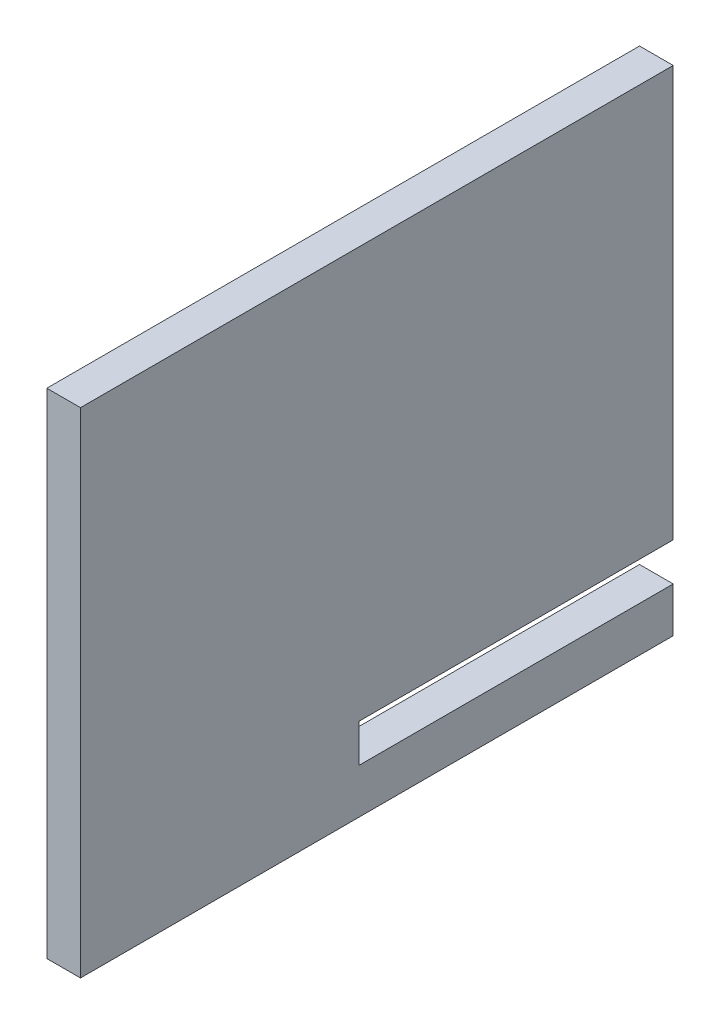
ISO-10303-21;
HEADER;
FILE_DESCRIPTION(('STEP AP214'),'2;1');
FILE_NAME('part.step','',(''),(''),'','','');
FILE_SCHEMA(('AUTOMOTIVE_DESIGN { 1 0 10303 214 1 1 1 1 }'));
ENDSEC;
DATA;
#1=APPLICATION_CONTEXT('core data for automotive mechanical design processes');
#2=APPLICATION_PROTOCOL_DEFINITION('international standard','automotive_design',2000,#1);
#3=PRODUCT_CONTEXT('',#1,'mechanical');
#4=PRODUCT('Part','Part','',(#3));
#5=PRODUCT_RELATED_PRODUCT_CATEGORY('part','',(#4));
#6=PRODUCT_DEFINITION_FORMATION('','',#4);
#7=PRODUCT_DEFINITION_CONTEXT('part definition',#1,'design');
#8=PRODUCT_DEFINITION('design','',#6,#7);
#9=PRODUCT_DEFINITION_SHAPE('','',#8);
#10=(LENGTH_UNIT() NAMED_UNIT(*) SI_UNIT(.MILLI.,.METRE.));
#11=(NAMED_UNIT(*) PLANE_ANGLE_UNIT() SI_UNIT($,.RADIAN.));
#12=(NAMED_UNIT(*) SI_UNIT($,.STERADIAN.) SOLID_ANGLE_UNIT());
#13=UNCERTAINTY_MEASURE_WITH_UNIT(LENGTH_MEASURE(1.E-05),#10,'distance_accuracy_value','');
#14=(GEOMETRIC_REPRESENTATION_CONTEXT(3) GLOBAL_UNCERTAINTY_ASSIGNED_CONTEXT((#13)) GLOBAL_UNIT_ASSIGNED_CONTEXT((#10,
#11,#12)) REPRESENTATION_CONTEXT('',''));
#15=CARTESIAN_POINT('',(0.,0.,0.));
#16=DIRECTION('',(0.,0.,1.));
#17=DIRECTION('',(1.,0.,0.));
#18=AXIS2_PLACEMENT_3D('',#15,#16,#17);
#19=CARTESIAN_POINT('',(0.,0.,0.));
#20=DIRECTION('',(0.,0.,-1.));
#21=DIRECTION('',(-1.,0.,0.));
#22=AXIS2_PLACEMENT_3D('',#19,#20,#21);
#23=PLANE('',#22);
#24=DIRECTION('',(1.,0.,0.));
#25=VECTOR('',#24,1.);
#26=CARTESIAN_POINT('',(-32.352836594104,-0.850000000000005,0.));
#27=LINE('',#26,#25);
#28=CARTESIAN_POINT('',(-18.25,-0.850000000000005,0.));
#29=VERTEX_POINT('',#28);
#30=CARTESIAN_POINT('',(-16.75,-0.850000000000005,0.));
#31=VERTEX_POINT('',#30);
#32=EDGE_CURVE('E111',#29,#31,#27,.T.);
#33=ORIENTED_EDGE('',*,*,#32,.T.);
#34=DIRECTION('',(0.,1.,0.));
#35=VECTOR('',#34,1.);
#36=CARTESIAN_POINT('',(-16.75,-39.75,0.));
#37=LINE('',#36,#35);
#38=CARTESIAN_POINT('',(-16.75,-19.15,0.));
#39=VERTEX_POINT('',#38);
#40=EDGE_CURVE('E108',#39,#31,#37,.T.);
#41=ORIENTED_EDGE('',*,*,#40,.F.);
#42=DIRECTION('',(1.,0.,0.));
#43=VECTOR('',#42,1.);
#44=CARTESIAN_POINT('',(-32.352836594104,-19.15,0.));
#45=LINE('',#44,#43);
#46=CARTESIAN_POINT('',(-18.25,-19.15,0.));
#47=VERTEX_POINT('',#46);
#48=EDGE_CURVE('E147',#47,#39,#45,.T.);
#49=ORIENTED_EDGE('',*,*,#48,.F.);
#50=DIRECTION('',(0.,-1.,0.));
#51=VECTOR('',#50,1.);
#52=CARTESIAN_POINT('',(-18.25,-39.75,0.));
#53=LINE('',#52,#51);
#54=EDGE_CURVE('E58',#29,#47,#53,.T.);
#55=ORIENTED_EDGE('',*,*,#54,.F.);
#56=EDGE_LOOP('',(#33,#41,#49,#55));
#57=FACE_BOUND('',#56,.T.);
#58=ADVANCED_FACE('F33',(#57),#23,.T.);
#59=DIRECTION('',(1.,0.,0.));
#60=VECTOR('',#59,1.);
#61=CARTESIAN_POINT('',(-66.6785040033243,-22.85,0.));
#62=LINE('',#61,#60);
#63=CARTESIAN_POINT('',(-18.25,-22.85,0.));
#64=VERTEX_POINT('',#63);
#65=CARTESIAN_POINT('',(-16.75,-22.85,0.));
#66=VERTEX_POINT('',#65);
#67=EDGE_CURVE('E124',#64,#66,#62,.T.);
#68=ORIENTED_EDGE('',*,*,#67,.F.);
#69=CARTESIAN_POINT('',(-18.25,-20.85,0.));
#70=VERTEX_POINT('',#69);
#71=EDGE_CURVE('E156',#70,#64,#53,.T.);
#72=ORIENTED_EDGE('',*,*,#71,.F.);
#73=DIRECTION('',(1.,0.,0.));
#74=VECTOR('',#73,1.);
#75=CARTESIAN_POINT('',(-32.352836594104,-20.85,0.));
#76=LINE('',#75,#74);
#77=CARTESIAN_POINT('',(-16.75,-20.85,0.));
#78=VERTEX_POINT('',#77);
#79=EDGE_CURVE('E136',#70,#78,#76,.T.);
#80=ORIENTED_EDGE('',*,*,#79,.T.);
#81=EDGE_CURVE('E37',#66,#78,#37,.T.);
#82=ORIENTED_EDGE('',*,*,#81,.F.);
#83=EDGE_LOOP('',(#68,#72,#80,#82));
#84=FACE_BOUND('',#83,.T.);
#85=ADVANCED_FACE('F163',(#84),#23,.T.);
#86=CARTESIAN_POINT('',(-18.25,-39.75,26.4));
#87=DIRECTION('',(1.,0.,0.));
#88=DIRECTION('',(0.,0.,-1.));
#89=AXIS2_PLACEMENT_3D('',#86,#87,#88);
#90=PLANE('',#89);
#91=DIRECTION('',(0.,-1.,0.));
#92=VECTOR('',#91,1.);
#93=CARTESIAN_POINT('',(-18.25,-39.75,26.4));
#94=LINE('',#93,#92);
#95=CARTESIAN_POINT('',(-18.25,-0.850000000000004,26.4));
#96=VERTEX_POINT('',#95);
#97=CARTESIAN_POINT('',(-18.25,-22.85,26.4));
#98=VERTEX_POINT('',#97);
#99=EDGE_CURVE('E42',#96,#98,#94,.T.);
#100=ORIENTED_EDGE('',*,*,#99,.F.);
#101=DIRECTION('',(0.,0.,1.));
#102=VECTOR('',#101,1.);
#103=CARTESIAN_POINT('',(-18.25,-0.850000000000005,0.));
#104=LINE('',#103,#102);
#105=EDGE_CURVE('E117',#29,#96,#104,.T.);
#106=ORIENTED_EDGE('',*,*,#105,.F.);
#107=ORIENTED_EDGE('',*,*,#54,.T.);
#108=DIRECTION('',(0.,0.,-1.));
#109=VECTOR('',#108,1.);
#110=CARTESIAN_POINT('',(-18.25,-19.15,0.));
#111=LINE('',#110,#109);
#112=CARTESIAN_POINT('',(-18.25,-19.15,14.));
#113=VERTEX_POINT('',#112);
#114=EDGE_CURVE('E138',#113,#47,#111,.T.);
#115=ORIENTED_EDGE('',*,*,#114,.F.);
#116=DIRECTION('',(0.,1.,0.));
#117=VECTOR('',#116,1.);
#118=CARTESIAN_POINT('',(-18.25,-20.85,14.));
#119=LINE('',#118,#117);
#120=CARTESIAN_POINT('',(-18.25,-20.85,14.));
#121=VERTEX_POINT('',#120);
#122=EDGE_CURVE('E133',#121,#113,#119,.T.);
#123=ORIENTED_EDGE('',*,*,#122,.F.);
#124=DIRECTION('',(0.,0.,1.));
#125=VECTOR('',#124,1.);
#126=CARTESIAN_POINT('',(-18.25,-20.85,0.));
#127=LINE('',#126,#125);
#128=EDGE_CURVE('E135',#70,#121,#127,.T.);
#129=ORIENTED_EDGE('',*,*,#128,.F.);
#130=ORIENTED_EDGE('',*,*,#71,.T.);
#131=DIRECTION('',(0.,0.,-1.));
#132=VECTOR('',#131,1.);
#133=CARTESIAN_POINT('',(-18.25,-22.85,0.));
#134=LINE('',#133,#132);
#135=EDGE_CURVE('E112',#98,#64,#134,.T.);
#136=ORIENTED_EDGE('',*,*,#135,.F.);
#137=EDGE_LOOP('',(#100,#106,#107,#115,#123,#129,#130,#136));
#138=FACE_BOUND('',#137,.T.);
#139=ADVANCED_FACE('F35',(#138),#90,.F.);
#140=CARTESIAN_POINT('',(-16.75,-39.75,26.4));
#141=DIRECTION('',(-1.,0.,0.));
#142=DIRECTION('',(0.,0.,1.));
#143=AXIS2_PLACEMENT_3D('',#140,#141,#142);
#144=PLANE('',#143);
#145=DIRECTION('',(0.,0.,-1.));
#146=VECTOR('',#145,1.);
#147=CARTESIAN_POINT('',(-16.75,-0.850000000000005,0.));
#148=LINE('',#147,#146);
#149=CARTESIAN_POINT('',(-16.75,-0.850000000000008,26.4));
#150=VERTEX_POINT('',#149);
#151=EDGE_CURVE('E103',#150,#31,#148,.T.);
#152=ORIENTED_EDGE('',*,*,#151,.F.);
#153=DIRECTION('',(0.,1.,0.));
#154=VECTOR('',#153,1.);
#155=CARTESIAN_POINT('',(-16.75,-39.75,26.4));
#156=LINE('',#155,#154);
#157=CARTESIAN_POINT('',(-16.75,-22.85,26.4));
#158=VERTEX_POINT('',#157);
#159=EDGE_CURVE('E11',#158,#150,#156,.T.);
#160=ORIENTED_EDGE('',*,*,#159,.F.);
#161=DIRECTION('',(0.,0.,1.));
#162=VECTOR('',#161,1.);
#163=CARTESIAN_POINT('',(-16.75,-22.85,0.));
#164=LINE('',#163,#162);
#165=EDGE_CURVE('E50',#66,#158,#164,.T.);
#166=ORIENTED_EDGE('',*,*,#165,.F.);
#167=ORIENTED_EDGE('',*,*,#81,.T.);
#168=DIRECTION('',(0.,0.,-1.));
#169=VECTOR('',#168,1.);
#170=CARTESIAN_POINT('',(-16.75,-20.85,0.));
#171=LINE('',#170,#169);
#172=CARTESIAN_POINT('',(-16.75,-20.85,14.));
#173=VERTEX_POINT('',#172);
#174=EDGE_CURVE('E144',#173,#78,#171,.T.);
#175=ORIENTED_EDGE('',*,*,#174,.F.);
#176=DIRECTION('',(0.,-1.,0.));
#177=VECTOR('',#176,1.);
#178=CARTESIAN_POINT('',(-16.75,-20.85,14.));
#179=LINE('',#178,#177);
#180=CARTESIAN_POINT('',(-16.75,-19.15,14.));
#181=VERTEX_POINT('',#180);
#182=EDGE_CURVE('E141',#181,#173,#179,.T.);
#183=ORIENTED_EDGE('',*,*,#182,.F.);
#184=DIRECTION('',(0.,0.,1.));
#185=VECTOR('',#184,1.);
#186=CARTESIAN_POINT('',(-16.75,-19.15,0.));
#187=LINE('',#186,#185);
#188=EDGE_CURVE('E130',#39,#181,#187,.T.);
#189=ORIENTED_EDGE('',*,*,#188,.F.);
#190=ORIENTED_EDGE('',*,*,#40,.T.);
#191=EDGE_LOOP('',(#152,#160,#166,#167,#175,#183,#189,#190));
#192=FACE_BOUND('',#191,.T.);
#193=ADVANCED_FACE('F105',(#192),#144,.F.);
#194=CARTESIAN_POINT('',(0.,0.,26.4));
#195=DIRECTION('',(0.,0.,-1.));
#196=DIRECTION('',(-1.,0.,0.));
#197=AXIS2_PLACEMENT_3D('',#194,#195,#196);
#198=PLANE('',#197);
#199=ORIENTED_EDGE('',*,*,#159,.T.);
#200=DIRECTION('',(1.,0.,0.));
#201=VECTOR('',#200,1.);
#202=CARTESIAN_POINT('',(-66.6785040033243,-0.850000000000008,26.4));
#203=LINE('',#202,#201);
#204=EDGE_CURVE('E115',#96,#150,#203,.T.);
#205=ORIENTED_EDGE('',*,*,#204,.F.);
#206=ORIENTED_EDGE('',*,*,#99,.T.);
#207=DIRECTION('',(1.,0.,0.));
#208=VECTOR('',#207,1.);
#209=CARTESIAN_POINT('',(-66.6785040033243,-22.85,26.4));
#210=LINE('',#209,#208);
#211=EDGE_CURVE('E122',#98,#158,#210,.T.);
#212=ORIENTED_EDGE('',*,*,#211,.T.);
#213=EDGE_LOOP('',(#199,#205,#206,#212));
#214=FACE_BOUND('',#213,.T.);
#215=ADVANCED_FACE('F121',(#214),#198,.F.);
#216=CARTESIAN_POINT('',(-32.352836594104,-20.85,0.));
#217=DIRECTION('',(0.,-1.,0.));
#218=DIRECTION('',(0.,0.,-1.));
#219=AXIS2_PLACEMENT_3D('',#216,#217,#218);
#220=PLANE('',#219);
#221=ORIENTED_EDGE('',*,*,#128,.T.);
#222=DIRECTION('',(1.,0.,0.));
#223=VECTOR('',#222,1.);
#224=CARTESIAN_POINT('',(-32.352836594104,-20.85,14.));
#225=LINE('',#224,#223);
#226=EDGE_CURVE('E150',#121,#173,#225,.T.);
#227=ORIENTED_EDGE('',*,*,#226,.T.);
#228=ORIENTED_EDGE('',*,*,#174,.T.);
#229=ORIENTED_EDGE('',*,*,#79,.F.);
#230=EDGE_LOOP('',(#221,#227,#228,#229));
#231=FACE_BOUND('',#230,.T.);
#232=ADVANCED_FACE('F169',(#231),#220,.F.);
#233=CARTESIAN_POINT('',(-32.352836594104,-20.85,14.));
#234=DIRECTION('',(0.,0.,1.));
#235=DIRECTION('',(1.,0.,0.));
#236=AXIS2_PLACEMENT_3D('',#233,#234,#235);
#237=PLANE('',#236);
#238=ORIENTED_EDGE('',*,*,#122,.T.);
#239=DIRECTION('',(1.,0.,0.));
#240=VECTOR('',#239,1.);
#241=CARTESIAN_POINT('',(-32.352836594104,-19.15,14.));
#242=LINE('',#241,#240);
#243=EDGE_CURVE('E152',#113,#181,#242,.T.);
#244=ORIENTED_EDGE('',*,*,#243,.T.);
#245=ORIENTED_EDGE('',*,*,#182,.T.);
#246=ORIENTED_EDGE('',*,*,#226,.F.);
#247=EDGE_LOOP('',(#238,#244,#245,#246));
#248=FACE_BOUND('',#247,.T.);
#249=ADVANCED_FACE('F172',(#248),#237,.F.);
#250=CARTESIAN_POINT('',(-32.352836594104,-19.15,0.));
#251=DIRECTION('',(0.,1.,0.));
#252=DIRECTION('',(0.,0.,1.));
#253=AXIS2_PLACEMENT_3D('',#250,#251,#252);
#254=PLANE('',#253);
#255=ORIENTED_EDGE('',*,*,#114,.T.);
#256=ORIENTED_EDGE('',*,*,#48,.T.);
#257=ORIENTED_EDGE('',*,*,#188,.T.);
#258=ORIENTED_EDGE('',*,*,#243,.F.);
#259=EDGE_LOOP('',(#255,#256,#257,#258));
#260=FACE_BOUND('',#259,.T.);
#261=ADVANCED_FACE('F177',(#260),#254,.F.);
#262=CARTESIAN_POINT('',(-32.352836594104,-0.850000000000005,0.));
#263=DIRECTION('',(0.,-1.,0.));
#264=DIRECTION('',(0.,0.,-1.));
#265=AXIS2_PLACEMENT_3D('',#262,#263,#264);
#266=PLANE('',#265);
#267=ORIENTED_EDGE('',*,*,#105,.T.);
#268=ORIENTED_EDGE('',*,*,#204,.T.);
#269=ORIENTED_EDGE('',*,*,#151,.T.);
#270=ORIENTED_EDGE('',*,*,#32,.F.);
#271=EDGE_LOOP('',(#267,#268,#269,#270));
#272=FACE_BOUND('',#271,.T.);
#273=ADVANCED_FACE('F116',(#272),#266,.F.);
#274=CARTESIAN_POINT('',(-66.6785040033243,-22.85,0.));
#275=DIRECTION('',(0.,1.,0.));
#276=DIRECTION('',(0.,0.,1.));
#277=AXIS2_PLACEMENT_3D('',#274,#275,#276);
#278=PLANE('',#277);
#279=ORIENTED_EDGE('',*,*,#135,.T.);
#280=ORIENTED_EDGE('',*,*,#67,.T.);
#281=ORIENTED_EDGE('',*,*,#165,.T.);
#282=ORIENTED_EDGE('',*,*,#211,.F.);
#283=EDGE_LOOP('',(#279,#280,#281,#282));
#284=FACE_BOUND('',#283,.T.);
#285=ADVANCED_FACE('F165',(#284),#278,.F.);
#286=CLOSED_SHELL('',(#58,#85,#139,#193,#215,#232,#249,#261,#273,#285));
#287=MANIFOLD_SOLID_BREP('B2',#286);
#288=ADVANCED_BREP_SHAPE_REPRESENTATION('',(#18,#287),#14);
#289=SHAPE_DEFINITION_REPRESENTATION(#9,#288);
ENDSEC;
END-ISO-10303-21;
